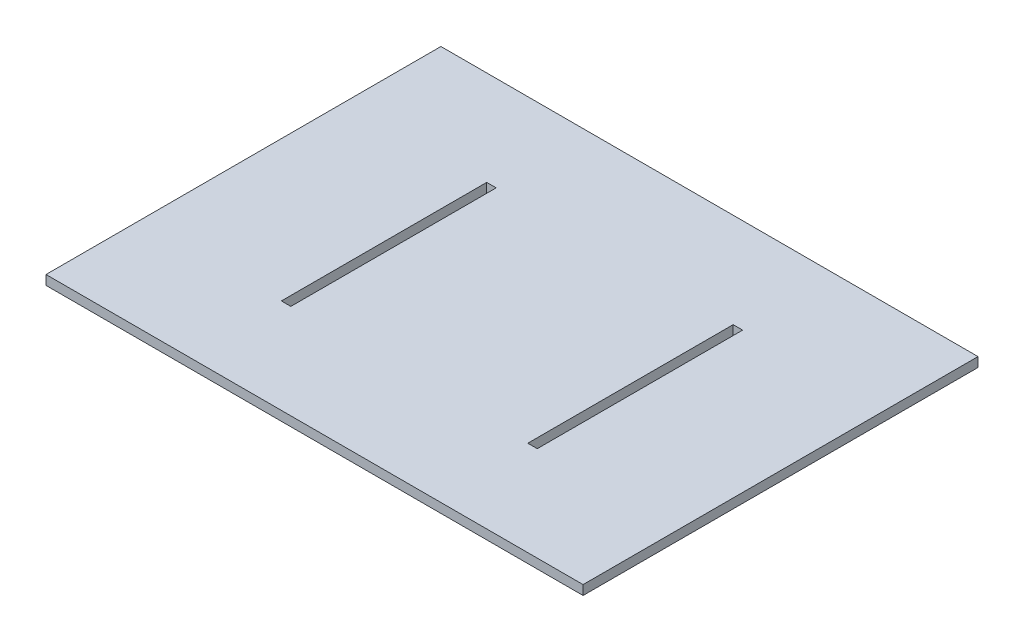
from build123d import *

# Parameters (mm, degrees)
SKETCH1_W           = 680
SKETCH1_H           = 500
BOSS_EXTRUDE1_DEPTH = 12
SKETCH2_W           = 12
SKETCH2_H           = 260
CUT_EXTRUDE3_DEPTH  = 14


with BuildPart() as part:
    # Sketch1 → Boss-Extrude1 (new body)
    with BuildSketch(Plane(origin=(0, 0, 0), x_dir=(1, 0, 0), z_dir=(0, 1, 0))):
        with Locations((340, 250)):
            Rectangle(SKETCH1_W, SKETCH1_H)
    extrude(amount=BOSS_EXTRUDE1_DEPTH)

    # Sketch2 → Cut-Extrude3 (cut)
    with BuildSketch(Plane(origin=(0, 12, 0), x_dir=(1, 0, 0), z_dir=(0, 1, 0))):
        with Locations((184, 250)):
            Rectangle(SKETCH2_W, SKETCH2_H)
        with Locations((496, 250)):
            Rectangle(SKETCH2_W, SKETCH2_H)
    extrude(amount=-CUT_EXTRUDE3_DEPTH, mode=Mode.SUBTRACT)


solid = part.part
